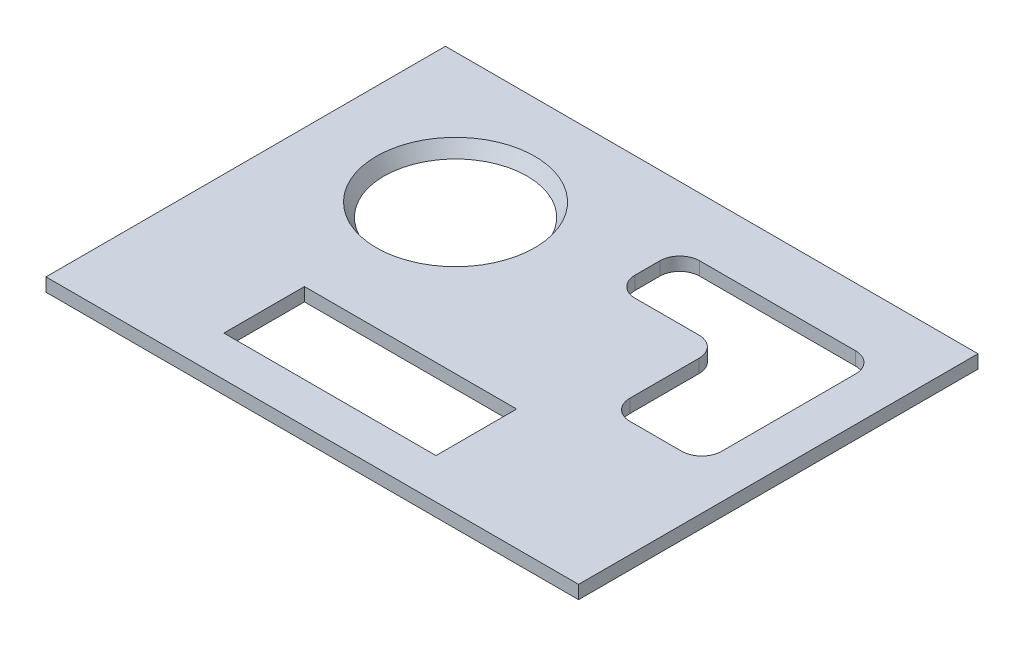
from build123d import *

# Parameters (mm, degrees)
SKETCH1_W          = 101.6
SKETCH1_H          = 76.2
EXTRUDE1_DEPTH     = 2.54
CUT_EXTRUDE1_DEPTH = 2.54
SKETCH3_W          = 40.473380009
SKETCH3_H          = 15.378028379
CUT_EXTRUDE2_DEPTH = 2.54
SKETCH4_R          = 15.11628624
CUT_EXTRUDE3_DEPTH = 2.54
CUT_EXTRUDE3_DRAFT = -30


with BuildPart() as part:
    # Sketch1 → Extrude1 (new body)
    with BuildSketch(Plane(origin=(0, 0, 0), x_dir=(1, 0, 0), z_dir=(0, 1, 0))):
        with Locations((50.8, 38.1)):
            Rectangle(SKETCH1_W, SKETCH1_H)
    extrude(amount=EXTRUDE1_DEPTH)

    # Sketch2 → Cut-Extrude1 (cut)
    with BuildSketch(Plane(origin=(0, 2.54, 0), x_dir=(-1, 0, 0), z_dir=(0, 1, 0))):
        with BuildLine():
            Line((-93.264166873, -61.201734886), (-93.264166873, -35.641389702))
            ThreePointArc((-93.264166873, -35.641389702), (-92.14824371, -32.947312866), (-89.454166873, -31.831389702))
            Line((-89.454166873, -31.831389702), (-79.544645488, -31.831389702))
            ThreePointArc((-79.544645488, -31.831389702), (-76.850568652, -32.947312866), (-75.734645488, -35.641389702))
            Line((-75.734645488, -35.641389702), (-75.734645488, -48.857423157))
            ThreePointArc((-75.734645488, -48.857423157), (-74.618722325, -51.551499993), (-71.924645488, -52.667423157))
            Line((-71.924645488, -52.667423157), (-59.705573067, -52.667423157))
            ThreePointArc((-59.705573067, -52.667423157), (-57.011496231, -53.783346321), (-55.895573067, -56.477423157))
            Line((-55.895573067, -56.477423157), (-55.895573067, -61.201734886))
            ThreePointArc((-55.895573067, -61.201734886), (-57.011496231, -63.895811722), (-59.705573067, -65.011734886))
            Line((-59.705573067, -65.011734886), (-89.454166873, -65.011734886))
            ThreePointArc((-89.454166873, -65.011734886), (-92.14824371, -63.895811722), (-93.264166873, -61.201734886))
        make_face()
    extrude(amount=-CUT_EXTRUDE1_DEPTH, mode=Mode.SUBTRACT)

    # Sketch3 → Cut-Extrude2 (cut)
    with BuildSketch(Plane(origin=(0, 2.54, 0), x_dir=(-1, 0, 0), z_dir=(0, 1, 0))):
        with Locations((-46.485326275, -15.369286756)):
            Rectangle(SKETCH3_W, SKETCH3_H)
    extrude(amount=-CUT_EXTRUDE2_DEPTH, mode=Mode.SUBTRACT)


with BuildPart() as cut_extrude3_tool:
    # Sketch4 → Cut-Extrude3 (with draft: the straight prism first)
    with BuildSketch(Plane(origin=(0, 2.54, 0), x_dir=(-1, 0, 0), z_dir=(0, 1, 0))):
        with Locations((-26.695231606, -51.435627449)):
            Circle(SKETCH4_R)
    extrude(amount=-CUT_EXTRUDE3_DEPTH)
    # Cut-Extrude3: the draft: its side faces are tilted about the plane it starts from
    cut_extrude3_sides = [cut_extrude3_tool.faces().sort_by_distance(p)[0] for p in [
        (41.811517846, 1.27, -51.435627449),
    ]]
    draft(cut_extrude3_sides, Plane(origin=(0, 2.54, 0), x_dir=(-1, 0, 0), z_dir=(0, 1, 0)), CUT_EXTRUDE3_DRAFT)


with BuildPart() as part_1:
    add(part.part)

    # Cut-Extrude3: cut by cut_extrude3_tool
    add(cut_extrude3_tool.part, mode=Mode.SUBTRACT)


solid = part_1.part
